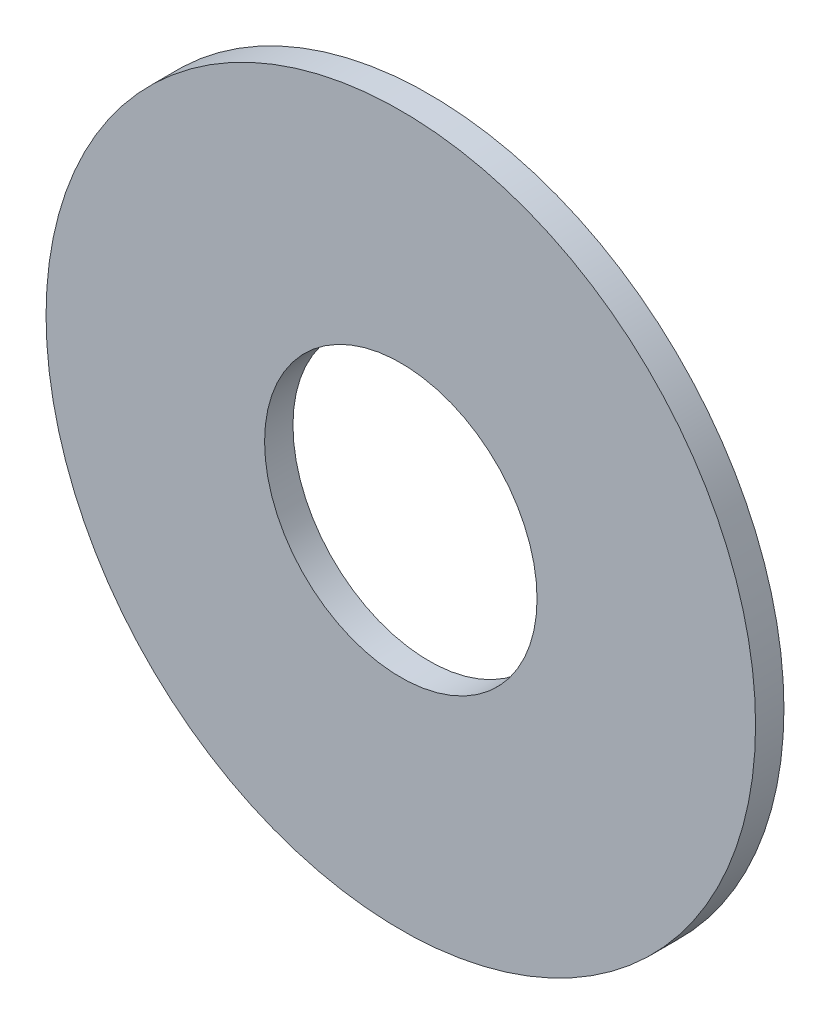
from build123d import *

# Parameters (mm, degrees)
SKETCH1_R           = 6.25
SKETCH1_R_2         = 2.4
SHAFT_WASHERS_DEPTH = 0.5


with BuildPart() as part:
    # Sketch1 → shaft washers (new body)
    with BuildSketch(Plane.XY):
        Circle(SKETCH1_R)
        Circle(SKETCH1_R_2, mode=Mode.SUBTRACT)
    extrude(amount=SHAFT_WASHERS_DEPTH)


solid = part.part
